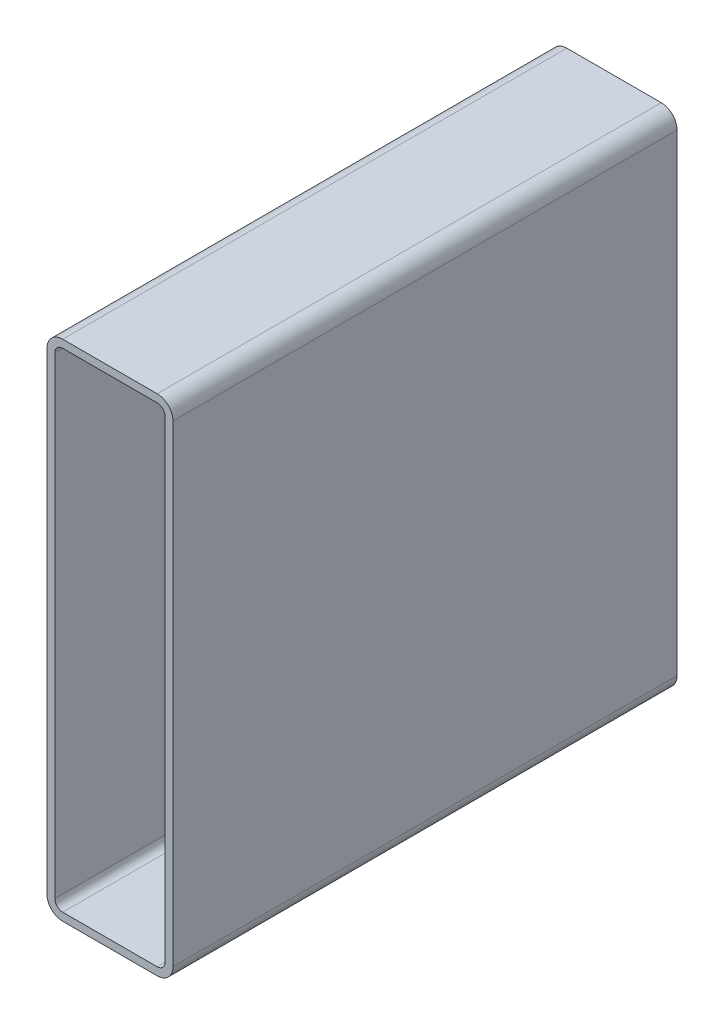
ISO-10303-21;
HEADER;
FILE_DESCRIPTION(('STEP AP214'),'2;1');
FILE_NAME('part.step','',(''),(''),'','','');
FILE_SCHEMA(('AUTOMOTIVE_DESIGN { 1 0 10303 214 1 1 1 1 }'));
ENDSEC;
DATA;
#1=APPLICATION_CONTEXT('core data for automotive mechanical design processes');
#2=APPLICATION_PROTOCOL_DEFINITION('international standard','automotive_design',2000,#1);
#3=PRODUCT_CONTEXT('',#1,'mechanical');
#4=PRODUCT('Part','Part','',(#3));
#5=PRODUCT_RELATED_PRODUCT_CATEGORY('part','',(#4));
#6=PRODUCT_DEFINITION_FORMATION('','',#4);
#7=PRODUCT_DEFINITION_CONTEXT('part definition',#1,'design');
#8=PRODUCT_DEFINITION('design','',#6,#7);
#9=PRODUCT_DEFINITION_SHAPE('','',#8);
#10=(LENGTH_UNIT() NAMED_UNIT(*) SI_UNIT(.MILLI.,.METRE.));
#11=(NAMED_UNIT(*) PLANE_ANGLE_UNIT() SI_UNIT($,.RADIAN.));
#12=(NAMED_UNIT(*) SI_UNIT($,.STERADIAN.) SOLID_ANGLE_UNIT());
#13=UNCERTAINTY_MEASURE_WITH_UNIT(LENGTH_MEASURE(1.E-05),#10,'distance_accuracy_value','');
#14=(GEOMETRIC_REPRESENTATION_CONTEXT(3) GLOBAL_UNCERTAINTY_ASSIGNED_CONTEXT((#13)) GLOBAL_UNIT_ASSIGNED_CONTEXT((#10,
#11,#12)) REPRESENTATION_CONTEXT('',''));
#15=CARTESIAN_POINT('',(0.,0.,0.));
#16=DIRECTION('',(0.,0.,1.));
#17=DIRECTION('',(1.,0.,0.));
#18=AXIS2_PLACEMENT_3D('',#15,#16,#17);
#19=CARTESIAN_POINT('',(12.0141160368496,297.149496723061,304.8));
#20=DIRECTION('',(0.,0.,1.));
#21=DIRECTION('',(1.,0.,0.));
#22=AXIS2_PLACEMENT_3D('',#19,#20,#21);
#23=PLANE('',#22);
#24=CARTESIAN_POINT('',(12.0141160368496,297.149496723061,304.8));
#25=DIRECTION('',(0.,0.,1.));
#26=DIRECTION('',(1.,0.,0.));
#27=AXIS2_PLACEMENT_3D('',#24,#25,#26);
#28=CIRCLE('',#27,9.52500000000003);
#29=CARTESIAN_POINT('',(12.0141160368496,306.674496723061,304.8));
#30=VERTEX_POINT('',#29);
#31=CARTESIAN_POINT('',(2.48911603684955,297.149496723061,304.8));
#32=VERTEX_POINT('',#31);
#33=EDGE_CURVE('E211',#30,#32,#28,.T.);
#34=ORIENTED_EDGE('',*,*,#33,.T.);
#35=DIRECTION('',(0.,-1.,0.));
#36=VECTOR('',#35,1.);
#37=CARTESIAN_POINT('',(2.48911603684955,11.3994967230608,304.8));
#38=LINE('',#37,#36);
#39=CARTESIAN_POINT('',(2.48911603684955,11.3994967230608,304.8));
#40=VERTEX_POINT('',#39);
#41=EDGE_CURVE('E214',#32,#40,#38,.T.);
#42=ORIENTED_EDGE('',*,*,#41,.T.);
#43=CARTESIAN_POINT('',(12.0141160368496,11.3994967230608,304.8));
#44=DIRECTION('',(0.,0.,1.));
#45=DIRECTION('',(1.,0.,0.));
#46=AXIS2_PLACEMENT_3D('',#43,#44,#45);
#47=CIRCLE('',#46,9.525);
#48=CARTESIAN_POINT('',(12.0141160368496,1.87449672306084,304.8));
#49=VERTEX_POINT('',#48);
#50=EDGE_CURVE('E217',#40,#49,#47,.T.);
#51=ORIENTED_EDGE('',*,*,#50,.T.);
#52=DIRECTION('',(1.,0.,0.));
#53=VECTOR('',#52,1.);
#54=CARTESIAN_POINT('',(69.1641160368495,1.87449672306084,304.8));
#55=LINE('',#54,#53);
#56=CARTESIAN_POINT('',(69.1641160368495,1.87449672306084,304.8));
#57=VERTEX_POINT('',#56);
#58=EDGE_CURVE('E219',#49,#57,#55,.T.);
#59=ORIENTED_EDGE('',*,*,#58,.T.);
#60=CARTESIAN_POINT('',(69.1641160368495,11.3994967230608,304.8));
#61=DIRECTION('',(0.,0.,1.));
#62=DIRECTION('',(1.,0.,0.));
#63=AXIS2_PLACEMENT_3D('',#60,#61,#62);
#64=CIRCLE('',#63,9.525);
#65=CARTESIAN_POINT('',(78.6891160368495,11.3994967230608,304.8));
#66=VERTEX_POINT('',#65);
#67=EDGE_CURVE('E221',#57,#66,#64,.T.);
#68=ORIENTED_EDGE('',*,*,#67,.T.);
#69=DIRECTION('',(0.,1.,0.));
#70=VECTOR('',#69,1.);
#71=CARTESIAN_POINT('',(78.6891160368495,297.149496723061,304.8));
#72=LINE('',#71,#70);
#73=CARTESIAN_POINT('',(78.6891160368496,297.149496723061,304.8));
#74=VERTEX_POINT('',#73);
#75=EDGE_CURVE('E223',#66,#74,#72,.T.);
#76=ORIENTED_EDGE('',*,*,#75,.T.);
#77=CARTESIAN_POINT('',(69.1641160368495,297.149496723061,304.8));
#78=DIRECTION('',(0.,0.,1.));
#79=DIRECTION('',(1.,0.,0.));
#80=AXIS2_PLACEMENT_3D('',#77,#78,#79);
#81=CIRCLE('',#80,9.52500000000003);
#82=CARTESIAN_POINT('',(69.1641160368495,306.674496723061,304.8));
#83=VERTEX_POINT('',#82);
#84=EDGE_CURVE('E225',#74,#83,#81,.T.);
#85=ORIENTED_EDGE('',*,*,#84,.T.);
#86=DIRECTION('',(-1.,0.,0.));
#87=VECTOR('',#86,1.);
#88=CARTESIAN_POINT('',(12.0141160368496,306.674496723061,304.8));
#89=LINE('',#88,#87);
#90=EDGE_CURVE('E227',#83,#30,#89,.T.);
#91=ORIENTED_EDGE('',*,*,#90,.T.);
#92=EDGE_LOOP('',(#34,#42,#51,#59,#68,#76,#85,#91));
#93=FACE_BOUND('',#92,.T.);
#94=DIRECTION('',(0.,-1.,0.));
#95=VECTOR('',#94,1.);
#96=CARTESIAN_POINT('',(7.25161603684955,11.3994967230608,304.8));
#97=LINE('',#96,#95);
#98=CARTESIAN_POINT('',(7.25161603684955,297.149496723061,304.8));
#99=VERTEX_POINT('',#98);
#100=CARTESIAN_POINT('',(7.25161603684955,11.3994967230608,304.8));
#101=VERTEX_POINT('',#100);
#102=EDGE_CURVE('E154',#99,#101,#97,.T.);
#103=ORIENTED_EDGE('',*,*,#102,.F.);
#104=CARTESIAN_POINT('',(12.0141160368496,297.149496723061,304.8));
#105=DIRECTION('',(0.,0.,1.));
#106=DIRECTION('',(1.,0.,0.));
#107=AXIS2_PLACEMENT_3D('',#104,#105,#106);
#108=CIRCLE('',#107,4.7625);
#109=CARTESIAN_POINT('',(12.0141160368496,301.911996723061,304.8));
#110=VERTEX_POINT('',#109);
#111=EDGE_CURVE('E146',#110,#99,#108,.T.);
#112=ORIENTED_EDGE('',*,*,#111,.F.);
#113=DIRECTION('',(-1.,0.,0.));
#114=VECTOR('',#113,1.);
#115=CARTESIAN_POINT('',(12.0141160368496,301.911996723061,304.8));
#116=LINE('',#115,#114);
#117=CARTESIAN_POINT('',(69.1641160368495,301.911996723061,304.8));
#118=VERTEX_POINT('',#117);
#119=EDGE_CURVE('E179',#118,#110,#116,.T.);
#120=ORIENTED_EDGE('',*,*,#119,.F.);
#121=CARTESIAN_POINT('',(69.1641160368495,297.149496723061,304.8));
#122=DIRECTION('',(0.,0.,1.));
#123=DIRECTION('',(1.,0.,0.));
#124=AXIS2_PLACEMENT_3D('',#121,#122,#123);
#125=CIRCLE('',#124,4.7625);
#126=CARTESIAN_POINT('',(73.9266160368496,297.149496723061,304.8));
#127=VERTEX_POINT('',#126);
#128=EDGE_CURVE('E177',#127,#118,#125,.T.);
#129=ORIENTED_EDGE('',*,*,#128,.F.);
#130=DIRECTION('',(0.,1.,0.));
#131=VECTOR('',#130,1.);
#132=CARTESIAN_POINT('',(73.9266160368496,297.149496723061,304.8));
#133=LINE('',#132,#131);
#134=CARTESIAN_POINT('',(73.9266160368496,11.3994967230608,304.8));
#135=VERTEX_POINT('',#134);
#136=EDGE_CURVE('E175',#135,#127,#133,.T.);
#137=ORIENTED_EDGE('',*,*,#136,.F.);
#138=CARTESIAN_POINT('',(69.1641160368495,11.3994967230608,304.8));
#139=DIRECTION('',(0.,0.,1.));
#140=DIRECTION('',(1.,0.,0.));
#141=AXIS2_PLACEMENT_3D('',#138,#139,#140);
#142=CIRCLE('',#141,4.7625);
#143=CARTESIAN_POINT('',(69.1641160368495,6.63699672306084,304.8));
#144=VERTEX_POINT('',#143);
#145=EDGE_CURVE('E173',#144,#135,#142,.T.);
#146=ORIENTED_EDGE('',*,*,#145,.F.);
#147=DIRECTION('',(1.,0.,0.));
#148=VECTOR('',#147,1.);
#149=CARTESIAN_POINT('',(69.1641160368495,6.63699672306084,304.8));
#150=LINE('',#149,#148);
#151=CARTESIAN_POINT('',(12.0141160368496,6.63699672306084,304.8));
#152=VERTEX_POINT('',#151);
#153=EDGE_CURVE('E169',#152,#144,#150,.T.);
#154=ORIENTED_EDGE('',*,*,#153,.F.);
#155=CARTESIAN_POINT('',(12.0141160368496,11.3994967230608,304.8));
#156=DIRECTION('',(0.,0.,1.));
#157=DIRECTION('',(1.,0.,0.));
#158=AXIS2_PLACEMENT_3D('',#155,#156,#157);
#159=CIRCLE('',#158,4.7625);
#160=EDGE_CURVE('E167',#101,#152,#159,.T.);
#161=ORIENTED_EDGE('',*,*,#160,.F.);
#162=EDGE_LOOP('',(#103,#112,#120,#129,#137,#146,#154,#161));
#163=FACE_BOUND('',#162,.T.);
#164=ADVANCED_FACE('F33',(#93,#163),#23,.T.);
#165=CARTESIAN_POINT('',(12.0141160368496,297.149496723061,0.));
#166=DIRECTION('',(0.,0.,1.));
#167=DIRECTION('',(1.,0.,0.));
#168=AXIS2_PLACEMENT_3D('',#165,#166,#167);
#169=PLANE('',#168);
#170=CARTESIAN_POINT('',(12.0141160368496,297.149496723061,0.));
#171=DIRECTION('',(0.,0.,1.));
#172=DIRECTION('',(1.,0.,0.));
#173=AXIS2_PLACEMENT_3D('',#170,#171,#172);
#174=CIRCLE('',#173,9.52500000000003);
#175=CARTESIAN_POINT('',(12.0141160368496,306.674496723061,0.));
#176=VERTEX_POINT('',#175);
#177=CARTESIAN_POINT('',(2.48911603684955,297.149496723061,0.));
#178=VERTEX_POINT('',#177);
#179=EDGE_CURVE('E162',#176,#178,#174,.T.);
#180=ORIENTED_EDGE('',*,*,#179,.F.);
#181=DIRECTION('',(-1.,0.,0.));
#182=VECTOR('',#181,1.);
#183=CARTESIAN_POINT('',(12.0141160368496,306.674496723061,0.));
#184=LINE('',#183,#182);
#185=CARTESIAN_POINT('',(69.1641160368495,306.674496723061,0.));
#186=VERTEX_POINT('',#185);
#187=EDGE_CURVE('E215',#186,#176,#184,.T.);
#188=ORIENTED_EDGE('',*,*,#187,.F.);
#189=CARTESIAN_POINT('',(69.1641160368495,297.149496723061,0.));
#190=DIRECTION('',(0.,0.,1.));
#191=DIRECTION('',(1.,0.,0.));
#192=AXIS2_PLACEMENT_3D('',#189,#190,#191);
#193=CIRCLE('',#192,9.52500000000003);
#194=CARTESIAN_POINT('',(78.6891160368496,297.149496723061,0.));
#195=VERTEX_POINT('',#194);
#196=EDGE_CURVE('E242',#195,#186,#193,.T.);
#197=ORIENTED_EDGE('',*,*,#196,.F.);
#198=DIRECTION('',(0.,1.,0.));
#199=VECTOR('',#198,1.);
#200=CARTESIAN_POINT('',(78.6891160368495,297.149496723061,0.));
#201=LINE('',#200,#199);
#202=CARTESIAN_POINT('',(78.6891160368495,11.3994967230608,0.));
#203=VERTEX_POINT('',#202);
#204=EDGE_CURVE('E240',#203,#195,#201,.T.);
#205=ORIENTED_EDGE('',*,*,#204,.F.);
#206=CARTESIAN_POINT('',(69.1641160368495,11.3994967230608,0.));
#207=DIRECTION('',(0.,0.,1.));
#208=DIRECTION('',(1.,0.,0.));
#209=AXIS2_PLACEMENT_3D('',#206,#207,#208);
#210=CIRCLE('',#209,9.525);
#211=CARTESIAN_POINT('',(69.1641160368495,1.87449672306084,0.));
#212=VERTEX_POINT('',#211);
#213=EDGE_CURVE('E238',#212,#203,#210,.T.);
#214=ORIENTED_EDGE('',*,*,#213,.F.);
#215=DIRECTION('',(1.,0.,0.));
#216=VECTOR('',#215,1.);
#217=CARTESIAN_POINT('',(69.1641160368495,1.87449672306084,0.));
#218=LINE('',#217,#216);
#219=CARTESIAN_POINT('',(12.0141160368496,1.87449672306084,0.));
#220=VERTEX_POINT('',#219);
#221=EDGE_CURVE('E236',#220,#212,#218,.T.);
#222=ORIENTED_EDGE('',*,*,#221,.F.);
#223=CARTESIAN_POINT('',(12.0141160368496,11.3994967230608,0.));
#224=DIRECTION('',(0.,0.,1.));
#225=DIRECTION('',(1.,0.,0.));
#226=AXIS2_PLACEMENT_3D('',#223,#224,#225);
#227=CIRCLE('',#226,9.525);
#228=CARTESIAN_POINT('',(2.48911603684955,11.3994967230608,0.));
#229=VERTEX_POINT('',#228);
#230=EDGE_CURVE('E234',#229,#220,#227,.T.);
#231=ORIENTED_EDGE('',*,*,#230,.F.);
#232=DIRECTION('',(0.,-1.,0.));
#233=VECTOR('',#232,1.);
#234=CARTESIAN_POINT('',(2.48911603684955,11.3994967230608,0.));
#235=LINE('',#234,#233);
#236=EDGE_CURVE('E232',#178,#229,#235,.T.);
#237=ORIENTED_EDGE('',*,*,#236,.F.);
#238=EDGE_LOOP('',(#180,#188,#197,#205,#214,#222,#231,#237));
#239=FACE_BOUND('',#238,.T.);
#240=CARTESIAN_POINT('',(12.0141160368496,297.149496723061,0.));
#241=DIRECTION('',(0.,0.,1.));
#242=DIRECTION('',(1.,0.,0.));
#243=AXIS2_PLACEMENT_3D('',#240,#241,#242);
#244=CIRCLE('',#243,4.7625);
#245=CARTESIAN_POINT('',(12.0141160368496,301.911996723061,0.));
#246=VERTEX_POINT('',#245);
#247=CARTESIAN_POINT('',(7.25161603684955,297.149496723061,0.));
#248=VERTEX_POINT('',#247);
#249=EDGE_CURVE('E56',#246,#248,#244,.T.);
#250=ORIENTED_EDGE('',*,*,#249,.T.);
#251=DIRECTION('',(0.,-1.,0.));
#252=VECTOR('',#251,1.);
#253=CARTESIAN_POINT('',(7.25161603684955,11.3994967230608,0.));
#254=LINE('',#253,#252);
#255=CARTESIAN_POINT('',(7.25161603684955,11.3994967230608,0.));
#256=VERTEX_POINT('',#255);
#257=EDGE_CURVE('E161',#248,#256,#254,.T.);
#258=ORIENTED_EDGE('',*,*,#257,.T.);
#259=CARTESIAN_POINT('',(12.0141160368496,11.3994967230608,0.));
#260=DIRECTION('',(0.,0.,1.));
#261=DIRECTION('',(1.,0.,0.));
#262=AXIS2_PLACEMENT_3D('',#259,#260,#261);
#263=CIRCLE('',#262,4.7625);
#264=CARTESIAN_POINT('',(12.0141160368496,6.63699672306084,0.));
#265=VERTEX_POINT('',#264);
#266=EDGE_CURVE('E183',#256,#265,#263,.T.);
#267=ORIENTED_EDGE('',*,*,#266,.T.);
#268=DIRECTION('',(1.,0.,0.));
#269=VECTOR('',#268,1.);
#270=CARTESIAN_POINT('',(69.1641160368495,6.63699672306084,0.));
#271=LINE('',#270,#269);
#272=CARTESIAN_POINT('',(69.1641160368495,6.63699672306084,0.));
#273=VERTEX_POINT('',#272);
#274=EDGE_CURVE('E186',#265,#273,#271,.T.);
#275=ORIENTED_EDGE('',*,*,#274,.T.);
#276=CARTESIAN_POINT('',(69.1641160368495,11.3994967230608,0.));
#277=DIRECTION('',(0.,0.,1.));
#278=DIRECTION('',(1.,0.,0.));
#279=AXIS2_PLACEMENT_3D('',#276,#277,#278);
#280=CIRCLE('',#279,4.7625);
#281=CARTESIAN_POINT('',(73.9266160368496,11.3994967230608,0.));
#282=VERTEX_POINT('',#281);
#283=EDGE_CURVE('E189',#273,#282,#280,.T.);
#284=ORIENTED_EDGE('',*,*,#283,.T.);
#285=DIRECTION('',(0.,1.,0.));
#286=VECTOR('',#285,1.);
#287=CARTESIAN_POINT('',(73.9266160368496,297.149496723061,0.));
#288=LINE('',#287,#286);
#289=CARTESIAN_POINT('',(73.9266160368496,297.149496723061,0.));
#290=VERTEX_POINT('',#289);
#291=EDGE_CURVE('E192',#282,#290,#288,.T.);
#292=ORIENTED_EDGE('',*,*,#291,.T.);
#293=CARTESIAN_POINT('',(69.1641160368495,297.149496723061,0.));
#294=DIRECTION('',(0.,0.,1.));
#295=DIRECTION('',(1.,0.,0.));
#296=AXIS2_PLACEMENT_3D('',#293,#294,#295);
#297=CIRCLE('',#296,4.7625);
#298=CARTESIAN_POINT('',(69.1641160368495,301.911996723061,0.));
#299=VERTEX_POINT('',#298);
#300=EDGE_CURVE('E195',#290,#299,#297,.T.);
#301=ORIENTED_EDGE('',*,*,#300,.T.);
#302=DIRECTION('',(-1.,0.,0.));
#303=VECTOR('',#302,1.);
#304=CARTESIAN_POINT('',(12.0141160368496,301.911996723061,0.));
#305=LINE('',#304,#303);
#306=EDGE_CURVE('E155',#299,#246,#305,.T.);
#307=ORIENTED_EDGE('',*,*,#306,.T.);
#308=EDGE_LOOP('',(#250,#258,#267,#275,#284,#292,#301,#307));
#309=FACE_BOUND('',#308,.T.);
#310=ADVANCED_FACE('F272',(#239,#309),#169,.F.);
#311=CARTESIAN_POINT('',(12.0141160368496,297.149496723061,304.8));
#312=DIRECTION('',(0.,0.,-1.));
#313=DIRECTION('',(-1.,0.,0.));
#314=AXIS2_PLACEMENT_3D('',#311,#312,#313);
#315=CYLINDRICAL_SURFACE('',#314,9.52500000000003);
#316=ORIENTED_EDGE('',*,*,#179,.T.);
#317=DIRECTION('',(0.,0.,-1.));
#318=VECTOR('',#317,1.);
#319=CARTESIAN_POINT('',(2.48911603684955,297.149496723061,304.8));
#320=LINE('',#319,#318);
#321=EDGE_CURVE('E11',#32,#178,#320,.T.);
#322=ORIENTED_EDGE('',*,*,#321,.F.);
#323=ORIENTED_EDGE('',*,*,#33,.F.);
#324=DIRECTION('',(0.,0.,-1.));
#325=VECTOR('',#324,1.);
#326=CARTESIAN_POINT('',(12.0141160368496,306.674496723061,304.8));
#327=LINE('',#326,#325);
#328=EDGE_CURVE('E229',#30,#176,#327,.T.);
#329=ORIENTED_EDGE('',*,*,#328,.T.);
#330=EDGE_LOOP('',(#316,#322,#323,#329));
#331=FACE_BOUND('',#330,.T.);
#332=ADVANCED_FACE('F35',(#331),#315,.T.);
#333=CARTESIAN_POINT('',(2.48911603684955,11.3994967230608,304.8));
#334=DIRECTION('',(1.,0.,0.));
#335=DIRECTION('',(0.,0.,-1.));
#336=AXIS2_PLACEMENT_3D('',#333,#334,#335);
#337=PLANE('',#336);
#338=ORIENTED_EDGE('',*,*,#236,.T.);
#339=DIRECTION('',(0.,0.,-1.));
#340=VECTOR('',#339,1.);
#341=CARTESIAN_POINT('',(2.48911603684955,11.3994967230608,304.8));
#342=LINE('',#341,#340);
#343=EDGE_CURVE('E41',#40,#229,#342,.T.);
#344=ORIENTED_EDGE('',*,*,#343,.F.);
#345=ORIENTED_EDGE('',*,*,#41,.F.);
#346=ORIENTED_EDGE('',*,*,#321,.T.);
#347=EDGE_LOOP('',(#338,#344,#345,#346));
#348=FACE_BOUND('',#347,.T.);
#349=ADVANCED_FACE('F289',(#348),#337,.F.);
#350=CARTESIAN_POINT('',(12.0141160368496,11.3994967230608,304.8));
#351=DIRECTION('',(0.,0.,-1.));
#352=DIRECTION('',(-1.,0.,0.));
#353=AXIS2_PLACEMENT_3D('',#350,#351,#352);
#354=CYLINDRICAL_SURFACE('',#353,9.525);
#355=ORIENTED_EDGE('',*,*,#230,.T.);
#356=DIRECTION('',(0.,0.,-1.));
#357=VECTOR('',#356,1.);
#358=CARTESIAN_POINT('',(12.0141160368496,1.87449672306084,304.8));
#359=LINE('',#358,#357);
#360=EDGE_CURVE('E259',#49,#220,#359,.T.);
#361=ORIENTED_EDGE('',*,*,#360,.F.);
#362=ORIENTED_EDGE('',*,*,#50,.F.);
#363=ORIENTED_EDGE('',*,*,#343,.T.);
#364=EDGE_LOOP('',(#355,#361,#362,#363));
#365=FACE_BOUND('',#364,.T.);
#366=ADVANCED_FACE('F266',(#365),#354,.T.);
#367=CARTESIAN_POINT('',(69.1641160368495,1.87449672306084,304.8));
#368=DIRECTION('',(0.,1.,0.));
#369=DIRECTION('',(0.,0.,1.));
#370=AXIS2_PLACEMENT_3D('',#367,#368,#369);
#371=PLANE('',#370);
#372=ORIENTED_EDGE('',*,*,#221,.T.);
#373=DIRECTION('',(0.,0.,-1.));
#374=VECTOR('',#373,1.);
#375=CARTESIAN_POINT('',(69.1641160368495,1.87449672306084,304.8));
#376=LINE('',#375,#374);
#377=EDGE_CURVE('E256',#57,#212,#376,.T.);
#378=ORIENTED_EDGE('',*,*,#377,.F.);
#379=ORIENTED_EDGE('',*,*,#58,.F.);
#380=ORIENTED_EDGE('',*,*,#360,.T.);
#381=EDGE_LOOP('',(#372,#378,#379,#380));
#382=FACE_BOUND('',#381,.T.);
#383=ADVANCED_FACE('F278',(#382),#371,.F.);
#384=CARTESIAN_POINT('',(69.1641160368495,11.3994967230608,304.8));
#385=DIRECTION('',(0.,0.,-1.));
#386=DIRECTION('',(-1.,0.,0.));
#387=AXIS2_PLACEMENT_3D('',#384,#385,#386);
#388=CYLINDRICAL_SURFACE('',#387,9.525);
#389=ORIENTED_EDGE('',*,*,#213,.T.);
#390=DIRECTION('',(0.,0.,-1.));
#391=VECTOR('',#390,1.);
#392=CARTESIAN_POINT('',(78.6891160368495,11.3994967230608,304.8));
#393=LINE('',#392,#391);
#394=EDGE_CURVE('E253',#66,#203,#393,.T.);
#395=ORIENTED_EDGE('',*,*,#394,.F.);
#396=ORIENTED_EDGE('',*,*,#67,.F.);
#397=ORIENTED_EDGE('',*,*,#377,.T.);
#398=EDGE_LOOP('',(#389,#395,#396,#397));
#399=FACE_BOUND('',#398,.T.);
#400=ADVANCED_FACE('F282',(#399),#388,.T.);
#401=CARTESIAN_POINT('',(78.6891160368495,297.149496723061,304.8));
#402=DIRECTION('',(-1.,0.,0.));
#403=DIRECTION('',(0.,0.,1.));
#404=AXIS2_PLACEMENT_3D('',#401,#402,#403);
#405=PLANE('',#404);
#406=ORIENTED_EDGE('',*,*,#204,.T.);
#407=DIRECTION('',(0.,0.,-1.));
#408=VECTOR('',#407,1.);
#409=CARTESIAN_POINT('',(78.6891160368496,297.149496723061,304.8));
#410=LINE('',#409,#408);
#411=EDGE_CURVE('E250',#74,#195,#410,.T.);
#412=ORIENTED_EDGE('',*,*,#411,.F.);
#413=ORIENTED_EDGE('',*,*,#75,.F.);
#414=ORIENTED_EDGE('',*,*,#394,.T.);
#415=EDGE_LOOP('',(#406,#412,#413,#414));
#416=FACE_BOUND('',#415,.T.);
#417=ADVANCED_FACE('F302',(#416),#405,.F.);
#418=CARTESIAN_POINT('',(69.1641160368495,297.149496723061,304.8));
#419=DIRECTION('',(0.,0.,-1.));
#420=DIRECTION('',(-1.,0.,0.));
#421=AXIS2_PLACEMENT_3D('',#418,#419,#420);
#422=CYLINDRICAL_SURFACE('',#421,9.52500000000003);
#423=ORIENTED_EDGE('',*,*,#196,.T.);
#424=DIRECTION('',(0.,0.,-1.));
#425=VECTOR('',#424,1.);
#426=CARTESIAN_POINT('',(69.1641160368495,306.674496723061,304.8));
#427=LINE('',#426,#425);
#428=EDGE_CURVE('E247',#83,#186,#427,.T.);
#429=ORIENTED_EDGE('',*,*,#428,.F.);
#430=ORIENTED_EDGE('',*,*,#84,.F.);
#431=ORIENTED_EDGE('',*,*,#411,.T.);
#432=EDGE_LOOP('',(#423,#429,#430,#431));
#433=FACE_BOUND('',#432,.T.);
#434=ADVANCED_FACE('F300',(#433),#422,.T.);
#435=CARTESIAN_POINT('',(12.0141160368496,306.674496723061,304.8));
#436=DIRECTION('',(0.,-1.,0.));
#437=DIRECTION('',(0.,0.,-1.));
#438=AXIS2_PLACEMENT_3D('',#435,#436,#437);
#439=PLANE('',#438);
#440=ORIENTED_EDGE('',*,*,#187,.T.);
#441=ORIENTED_EDGE('',*,*,#328,.F.);
#442=ORIENTED_EDGE('',*,*,#90,.F.);
#443=ORIENTED_EDGE('',*,*,#428,.T.);
#444=EDGE_LOOP('',(#440,#441,#442,#443));
#445=FACE_BOUND('',#444,.T.);
#446=ADVANCED_FACE('F295',(#445),#439,.F.);
#447=CARTESIAN_POINT('',(12.0141160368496,297.149496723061,304.8));
#448=DIRECTION('',(0.,0.,-1.));
#449=DIRECTION('',(-1.,0.,0.));
#450=AXIS2_PLACEMENT_3D('',#447,#448,#449);
#451=CYLINDRICAL_SURFACE('',#450,4.7625);
#452=ORIENTED_EDGE('',*,*,#249,.F.);
#453=DIRECTION('',(0.,0.,-1.));
#454=VECTOR('',#453,1.);
#455=CARTESIAN_POINT('',(12.0141160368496,301.911996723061,304.8));
#456=LINE('',#455,#454);
#457=EDGE_CURVE('E150',#110,#246,#456,.T.);
#458=ORIENTED_EDGE('',*,*,#457,.F.);
#459=ORIENTED_EDGE('',*,*,#111,.T.);
#460=DIRECTION('',(0.,0.,-1.));
#461=VECTOR('',#460,1.);
#462=CARTESIAN_POINT('',(7.25161603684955,297.149496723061,304.8));
#463=LINE('',#462,#461);
#464=EDGE_CURVE('E149',#99,#248,#463,.T.);
#465=ORIENTED_EDGE('',*,*,#464,.T.);
#466=EDGE_LOOP('',(#452,#458,#459,#465));
#467=FACE_BOUND('',#466,.T.);
#468=ADVANCED_FACE('F148',(#467),#451,.F.);
#469=CARTESIAN_POINT('',(7.25161603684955,11.3994967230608,304.8));
#470=DIRECTION('',(1.,0.,0.));
#471=DIRECTION('',(0.,0.,-1.));
#472=AXIS2_PLACEMENT_3D('',#469,#470,#471);
#473=PLANE('',#472);
#474=ORIENTED_EDGE('',*,*,#257,.F.);
#475=ORIENTED_EDGE('',*,*,#464,.F.);
#476=ORIENTED_EDGE('',*,*,#102,.T.);
#477=DIRECTION('',(0.,0.,-1.));
#478=VECTOR('',#477,1.);
#479=CARTESIAN_POINT('',(7.25161603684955,11.3994967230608,304.8));
#480=LINE('',#479,#478);
#481=EDGE_CURVE('E163',#101,#256,#480,.T.);
#482=ORIENTED_EDGE('',*,*,#481,.T.);
#483=EDGE_LOOP('',(#474,#475,#476,#482));
#484=FACE_BOUND('',#483,.T.);
#485=ADVANCED_FACE('F158',(#484),#473,.T.);
#486=CARTESIAN_POINT('',(12.0141160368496,11.3994967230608,304.8));
#487=DIRECTION('',(0.,0.,-1.));
#488=DIRECTION('',(-1.,0.,0.));
#489=AXIS2_PLACEMENT_3D('',#486,#487,#488);
#490=CYLINDRICAL_SURFACE('',#489,4.7625);
#491=ORIENTED_EDGE('',*,*,#266,.F.);
#492=ORIENTED_EDGE('',*,*,#481,.F.);
#493=ORIENTED_EDGE('',*,*,#160,.T.);
#494=DIRECTION('',(0.,0.,-1.));
#495=VECTOR('',#494,1.);
#496=CARTESIAN_POINT('',(12.0141160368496,6.63699672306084,304.8));
#497=LINE('',#496,#495);
#498=EDGE_CURVE('E208',#152,#265,#497,.T.);
#499=ORIENTED_EDGE('',*,*,#498,.T.);
#500=EDGE_LOOP('',(#491,#492,#493,#499));
#501=FACE_BOUND('',#500,.T.);
#502=ADVANCED_FACE('F327',(#501),#490,.F.);
#503=CARTESIAN_POINT('',(69.1641160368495,6.63699672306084,304.8));
#504=DIRECTION('',(0.,1.,0.));
#505=DIRECTION('',(0.,0.,1.));
#506=AXIS2_PLACEMENT_3D('',#503,#504,#505);
#507=PLANE('',#506);
#508=ORIENTED_EDGE('',*,*,#274,.F.);
#509=ORIENTED_EDGE('',*,*,#498,.F.);
#510=ORIENTED_EDGE('',*,*,#153,.T.);
#511=DIRECTION('',(0.,0.,-1.));
#512=VECTOR('',#511,1.);
#513=CARTESIAN_POINT('',(69.1641160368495,6.63699672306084,304.8));
#514=LINE('',#513,#512);
#515=EDGE_CURVE('E206',#144,#273,#514,.T.);
#516=ORIENTED_EDGE('',*,*,#515,.T.);
#517=EDGE_LOOP('',(#508,#509,#510,#516));
#518=FACE_BOUND('',#517,.T.);
#519=ADVANCED_FACE('F331',(#518),#507,.T.);
#520=CARTESIAN_POINT('',(69.1641160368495,11.3994967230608,304.8));
#521=DIRECTION('',(0.,0.,-1.));
#522=DIRECTION('',(-1.,0.,0.));
#523=AXIS2_PLACEMENT_3D('',#520,#521,#522);
#524=CYLINDRICAL_SURFACE('',#523,4.7625);
#525=ORIENTED_EDGE('',*,*,#283,.F.);
#526=ORIENTED_EDGE('',*,*,#515,.F.);
#527=ORIENTED_EDGE('',*,*,#145,.T.);
#528=DIRECTION('',(0.,0.,-1.));
#529=VECTOR('',#528,1.);
#530=CARTESIAN_POINT('',(73.9266160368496,11.3994967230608,304.8));
#531=LINE('',#530,#529);
#532=EDGE_CURVE('E204',#135,#282,#531,.T.);
#533=ORIENTED_EDGE('',*,*,#532,.T.);
#534=EDGE_LOOP('',(#525,#526,#527,#533));
#535=FACE_BOUND('',#534,.T.);
#536=ADVANCED_FACE('F337',(#535),#524,.F.);
#537=CARTESIAN_POINT('',(73.9266160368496,297.149496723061,304.8));
#538=DIRECTION('',(-1.,0.,0.));
#539=DIRECTION('',(0.,0.,1.));
#540=AXIS2_PLACEMENT_3D('',#537,#538,#539);
#541=PLANE('',#540);
#542=ORIENTED_EDGE('',*,*,#291,.F.);
#543=ORIENTED_EDGE('',*,*,#532,.F.);
#544=ORIENTED_EDGE('',*,*,#136,.T.);
#545=DIRECTION('',(0.,0.,-1.));
#546=VECTOR('',#545,1.);
#547=CARTESIAN_POINT('',(73.9266160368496,297.149496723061,304.8));
#548=LINE('',#547,#546);
#549=EDGE_CURVE('E202',#127,#290,#548,.T.);
#550=ORIENTED_EDGE('',*,*,#549,.T.);
#551=EDGE_LOOP('',(#542,#543,#544,#550));
#552=FACE_BOUND('',#551,.T.);
#553=ADVANCED_FACE('F341',(#552),#541,.T.);
#554=CARTESIAN_POINT('',(69.1641160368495,297.149496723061,304.8));
#555=DIRECTION('',(0.,0.,-1.));
#556=DIRECTION('',(-1.,0.,0.));
#557=AXIS2_PLACEMENT_3D('',#554,#555,#556);
#558=CYLINDRICAL_SURFACE('',#557,4.7625);
#559=ORIENTED_EDGE('',*,*,#300,.F.);
#560=ORIENTED_EDGE('',*,*,#549,.F.);
#561=ORIENTED_EDGE('',*,*,#128,.T.);
#562=DIRECTION('',(0.,0.,-1.));
#563=VECTOR('',#562,1.);
#564=CARTESIAN_POINT('',(69.1641160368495,301.911996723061,304.8));
#565=LINE('',#564,#563);
#566=EDGE_CURVE('E48',#118,#299,#565,.T.);
#567=ORIENTED_EDGE('',*,*,#566,.T.);
#568=EDGE_LOOP('',(#559,#560,#561,#567));
#569=FACE_BOUND('',#568,.T.);
#570=ADVANCED_FACE('F345',(#569),#558,.F.);
#571=CARTESIAN_POINT('',(12.0141160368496,301.911996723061,304.8));
#572=DIRECTION('',(0.,-1.,0.));
#573=DIRECTION('',(0.,0.,-1.));
#574=AXIS2_PLACEMENT_3D('',#571,#572,#573);
#575=PLANE('',#574);
#576=ORIENTED_EDGE('',*,*,#306,.F.);
#577=ORIENTED_EDGE('',*,*,#566,.F.);
#578=ORIENTED_EDGE('',*,*,#119,.T.);
#579=ORIENTED_EDGE('',*,*,#457,.T.);
#580=EDGE_LOOP('',(#576,#577,#578,#579));
#581=FACE_BOUND('',#580,.T.);
#582=ADVANCED_FACE('F349',(#581),#575,.T.);
#583=CLOSED_SHELL('',(#164,#310,#332,#349,#366,#383,#400,#417,#434,#446,#468,#485,#502,#519,
#536,#553,#570,#582));
#584=MANIFOLD_SOLID_BREP('B2',#583);
#585=ADVANCED_BREP_SHAPE_REPRESENTATION('',(#18,#584),#14);
#586=SHAPE_DEFINITION_REPRESENTATION(#9,#585);
ENDSEC;
END-ISO-10303-21;
